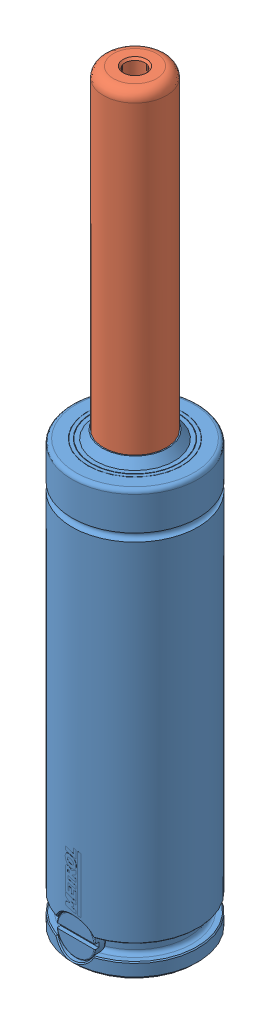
SolidWorks assembly EX360-080.SLDASM, configuration Default (file format 7000). Lengths in mm.
Overall size (33.76 190 33.76).
2 component instances, 2 part files, 5 mates.
Components (placement in the parent):
- EX0360 Body-1: EX0360 Body.SLDPRT [EX-360-080] x (0 0 1) z (0 -1 0) size (32.1 32 110)
- EX-360 Piston-1: EX-360 Piston.SLDPRT [EX-360-080] at (0 93 0) x (0.775453 0 0.631405) z (0 -1 0) size (24 24 97)
Mates (geometry in assembly coordinates):
- Concentric1: concentric aligned: cylinder of EX0360 Body-1 through (0 0 0) axis (0 -1 0) radius 8; cylinder of EX-360 Piston-1 through (0 93 0) axis (0 -1 0) radius 8
- LimitDistance1: limit distance anti-aligned: plane of EX-360 Piston-1 through (-7.5769 98 9.3054) normal (0 1 0); plane of EX0360 Body-1 through (0 98 0) normal (0 -1 0)
- Coincident1: coincident anti-aligned: plane of assembly through (0 0 0) normal (0 1 0); plane of EX0360 Body-1 through (0 0 0) normal (0 -1 0)
- Coincident2: coincident anti-aligned: plane of EX0360 Body-1; plane of assembly through (0 0 0) normal (1 0 0)
- Coincident4: coincident aligned: plane of EX0360 Body-1; plane of assembly through (0 0 0) normal (0 0 1)
